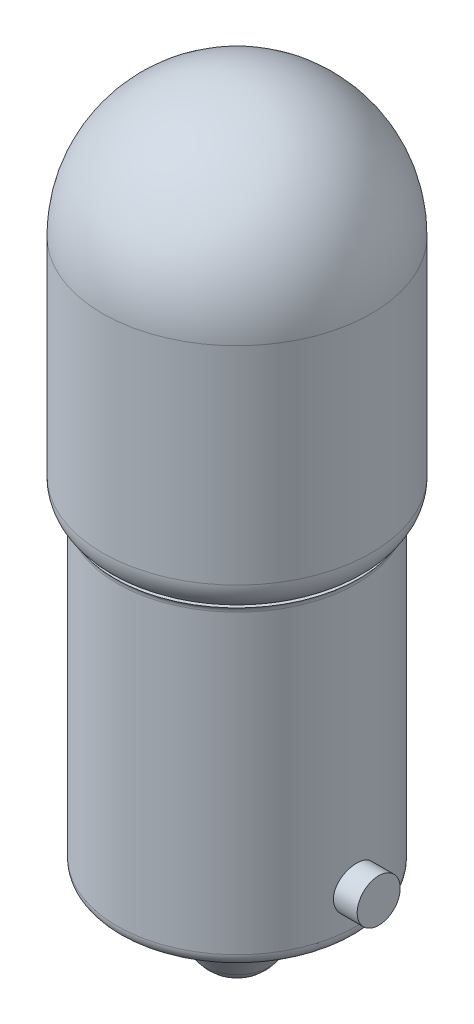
from build123d import *

# Parameters (mm, degrees)
SKETCH1_R                = 4.5974
BOSS_EXTRUDE1_DEPTH      = 11.8872
FILLET1_R                = 0.508
BOSS_EXTRUDE2_DEPTH      = 5.4356
BOSS_EXTRUDE2_DEPTH_BACK = 5.4356
SKETCH4_R                = 0.8255
CUT_EXTRUDE1_START       = -5.4356
SKETCH5_R                = 4.488538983
CUT_EXTRUDE1_DEPTH       = 5.4356


with BuildPart() as part:
    # Sketch1 → Boss-Extrude1 (new body)
    with BuildSketch(Plane(origin=(0, 0, 0), x_dir=(1, 0, 0), z_dir=(0, 1, 0))):
        with Locations(Location((0, 0, 0), (0, 0, 270))):
            Circle(SKETCH1_R)
    extrude(amount=BOSS_EXTRUDE1_DEPTH)

    # Sketch2 → Revolve1 (revolve)
    with BuildSketch(Plane(origin=(0, 0, 0), x_dir=(0, 0, -1), z_dir=(1, 0, 0)), mode=Mode.PRIVATE) as revolve1_sk:
        with BuildLine():
            Line((4.5974, 11.095160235), (4.5974, 11.8872))
            ThreePointArc((4.5974, 11.8872), (4.618786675, 11.995512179), (4.679736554, 12.087566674))
            Line((4.679736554, 12.087566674), (4.488538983, 12.087566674))
            Line((4.488538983, 12.087566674), (4.488538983, 11.095160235))
            Line((4.488538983, 11.095160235), (4.5974, 11.095160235))
        make_face()
    revolve(revolve1_sk.sketch.rotate(Axis((0, 11.8872, 0), (0, -1, 0)), 180), axis=Axis((0, 11.8872, 0), (0, -1, 0)))

    # Fillet1
    fillet1_edges = [part.edges().sort_by_distance(p)[0] for p in [
        (0, 0, -4.5974),
    ]]
    fillet(fillet1_edges, radius=FILLET1_R)

    # Sketch3 → Revolve2 (revolve)
    with BuildSketch(Plane(origin=(0, 0, 0), x_dir=(0, 0, -1), z_dir=(1, 0, 0)), mode=Mode.PRIVATE) as revolve2_sk:
        with BuildLine():
            Line((2.9845, 0), (1.255835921, -2.514395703))
            ThreePointArc((1.255835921, -2.514395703), (0.709493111, -2.999775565), (0, -3.175))
            Line((0, -3.175), (0, 0))
            Line((0, 0), (2.9845, 0))
        make_face()
    revolve(revolve2_sk.sketch.rotate(Axis((0, 0, 0), (0, -1, 0)), 180), axis=Axis((0, 0, 0), (0, -1, 0)))

    # Sketch4 → Boss-Extrude2 (add, two sides: drawn at the far end of the back side and taken through both)
    with BuildSketch(Plane(origin=(0, 0, 0), x_dir=(0, 0, -1), z_dir=(1, 0, 0)).offset(-BOSS_EXTRUDE2_DEPTH_BACK)):
        with Locations((0, 1.778)):
            Circle(SKETCH4_R)
    extrude(amount=BOSS_EXTRUDE2_DEPTH + BOSS_EXTRUDE2_DEPTH_BACK)

    # Sketch5 → Cut-Extrude1 (cut)
    with BuildSketch(Plane(origin=(0, 11.8872, 0), x_dir=(1, 0, 0), z_dir=(0, 1, 0)).offset(CUT_EXTRUDE1_START)):
        with Locations(Location((0, 0, 0), (0, 0, 270))):
            Circle(SKETCH5_R)
    extrude(amount=CUT_EXTRUDE1_DEPTH, mode=Mode.SUBTRACT)

    # Sketch6 → Revolve3 (revolve)
    with BuildSketch(Plane(origin=(0, 0, 0), x_dir=(0, 0, -1), z_dir=(1, 0, 0)), mode=Mode.PRIVATE) as revolve3_sk:
        with BuildLine():
            Line((5.1562, 21.1328), (5.1562, 13.182110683))
            ThreePointArc((5.1562, 13.182110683), (4.987811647, 12.550958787), (4.527404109, 12.087566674))
            Line((4.527404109, 12.087566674), (0, 12.087566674))
            Line((0, 12.087566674), (0, 26.289))
            ThreePointArc((0, 26.289), (3.645983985, 24.778783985), (5.1562, 21.1328))
        make_face()
    revolve(revolve3_sk.sketch.rotate(Axis((0, 11.8872, 0), (0, -1, 0)), 180), axis=Axis((0, 11.8872, 0), (0, -1, 0)))


solid = part.part
